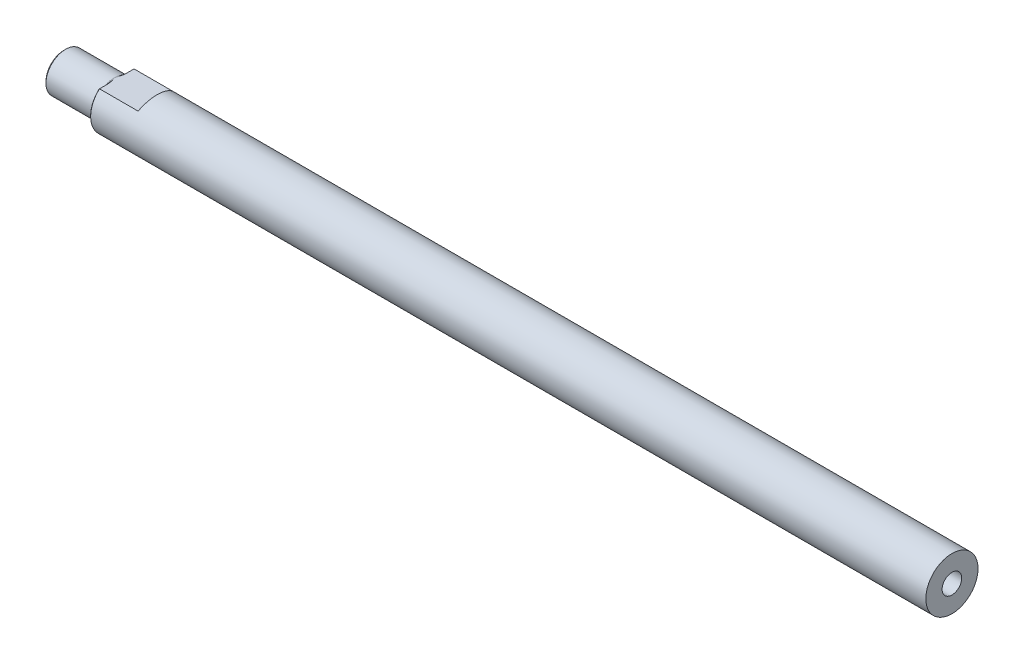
ISO-10303-21;
HEADER;
FILE_DESCRIPTION(('STEP AP214'),'2;1');
FILE_NAME('part.step','',(''),(''),'','','');
FILE_SCHEMA(('AUTOMOTIVE_DESIGN { 1 0 10303 214 1 1 1 1 }'));
ENDSEC;
DATA;
#1=APPLICATION_CONTEXT('core data for automotive mechanical design processes');
#2=APPLICATION_PROTOCOL_DEFINITION('international standard','automotive_design',2000,#1);
#3=PRODUCT_CONTEXT('',#1,'mechanical');
#4=PRODUCT('Part','Part','',(#3));
#5=PRODUCT_RELATED_PRODUCT_CATEGORY('part','',(#4));
#6=PRODUCT_DEFINITION_FORMATION('','',#4);
#7=PRODUCT_DEFINITION_CONTEXT('part definition',#1,'design');
#8=PRODUCT_DEFINITION('design','',#6,#7);
#9=PRODUCT_DEFINITION_SHAPE('','',#8);
#10=(LENGTH_UNIT() NAMED_UNIT(*) SI_UNIT(.MILLI.,.METRE.));
#11=(NAMED_UNIT(*) PLANE_ANGLE_UNIT() SI_UNIT($,.RADIAN.));
#12=(NAMED_UNIT(*) SI_UNIT($,.STERADIAN.) SOLID_ANGLE_UNIT());
#13=UNCERTAINTY_MEASURE_WITH_UNIT(LENGTH_MEASURE(1.E-05),#10,'distance_accuracy_value','');
#14=(GEOMETRIC_REPRESENTATION_CONTEXT(3) GLOBAL_UNCERTAINTY_ASSIGNED_CONTEXT((#13)) GLOBAL_UNIT_ASSIGNED_CONTEXT((#10,
#11,#12)) REPRESENTATION_CONTEXT('',''));
#15=CARTESIAN_POINT('',(0.,0.,0.));
#16=DIRECTION('',(0.,0.,1.));
#17=DIRECTION('',(1.,0.,0.));
#18=AXIS2_PLACEMENT_3D('',#15,#16,#17);
#19=CARTESIAN_POINT('',(-25.4,0.,0.));
#20=DIRECTION('',(1.,0.,0.));
#21=DIRECTION('',(0.,0.,-1.));
#22=AXIS2_PLACEMENT_3D('',#19,#20,#21);
#23=PLANE('',#22);
#24=CARTESIAN_POINT('',(-25.4,0.,0.));
#25=DIRECTION('',(1.,0.,0.));
#26=DIRECTION('',(0.,0.,-1.));
#27=AXIS2_PLACEMENT_3D('',#24,#25,#26);
#28=CIRCLE('',#27,8.76300000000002);
#29=CARTESIAN_POINT('',(-25.4,0.,-8.76300000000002));
#30=VERTEX_POINT('',#29);
#31=EDGE_CURVE('E107',#30,#30,#28,.F.);
#32=ORIENTED_EDGE('',*,*,#31,.T.);
#33=EDGE_LOOP('',(#32));
#34=FACE_BOUND('',#33,.T.);
#35=CARTESIAN_POINT('',(-25.4,0.,0.));
#36=DIRECTION('',(-1.,0.,0.));
#37=DIRECTION('',(0.,0.,1.));
#38=AXIS2_PLACEMENT_3D('',#35,#36,#37);
#39=CIRCLE('',#38,5.75437);
#40=CARTESIAN_POINT('',(-25.4,0.,5.75437));
#41=VERTEX_POINT('',#40);
#42=EDGE_CURVE('E120',#41,#41,#39,.T.);
#43=ORIENTED_EDGE('',*,*,#42,.F.);
#44=EDGE_LOOP('',(#43));
#45=FACE_BOUND('',#44,.T.);
#46=ADVANCED_FACE('F36',(#34,#45),#23,.F.);
#47=CARTESIAN_POINT('',(-34.7533783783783,0.,0.));
#48=DIRECTION('',(-1.,0.,0.));
#49=DIRECTION('',(0.,0.,1.));
#50=AXIS2_PLACEMENT_3D('',#47,#48,#49);
#51=CYLINDRICAL_SURFACE('',#50,9.525);
#52=CARTESIAN_POINT('',(-24.638,0.,0.));
#53=DIRECTION('',(1.,0.,0.));
#54=DIRECTION('',(0.,0.,-1.));
#55=AXIS2_PLACEMENT_3D('',#52,#53,#54);
#56=CIRCLE('',#55,9.525);
#57=CARTESIAN_POINT('',(-24.638,0.,-9.525));
#58=VERTEX_POINT('',#57);
#59=EDGE_CURVE('E328',#58,#58,#56,.T.);
#60=ORIENTED_EDGE('',*,*,#59,.T.);
#61=EDGE_LOOP('',(#60));
#62=FACE_BOUND('',#61,.T.);
#63=CARTESIAN_POINT('',(-0.761999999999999,0.,0.));
#64=DIRECTION('',(1.,0.,0.));
#65=DIRECTION('',(0.,0.,-1.));
#66=AXIS2_PLACEMENT_3D('',#63,#64,#65);
#67=CIRCLE('',#66,9.525);
#68=CARTESIAN_POINT('',(-0.761999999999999,9.525,0.));
#69=VERTEX_POINT('',#68);
#70=EDGE_CURVE('E129',#69,#69,#67,.F.);
#71=ORIENTED_EDGE('',*,*,#70,.T.);
#72=EDGE_LOOP('',(#71));
#73=FACE_BOUND('',#72,.T.);
#74=ADVANCED_FACE('F343',(#62,#73),#51,.T.);
#75=CARTESIAN_POINT('',(0.,9.525,0.));
#76=DIRECTION('',(1.,0.,0.));
#77=DIRECTION('',(0.,0.,-1.));
#78=AXIS2_PLACEMENT_3D('',#75,#76,#77);
#79=PLANE('',#78);
#80=CARTESIAN_POINT('',(0.,0.,0.));
#81=DIRECTION('',(1.,0.,0.));
#82=DIRECTION('',(0.,0.,-1.));
#83=AXIS2_PLACEMENT_3D('',#80,#81,#82);
#84=CIRCLE('',#83,10.287);
#85=CARTESIAN_POINT('',(0.,9.27100000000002,4.45768190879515));
#86=VERTEX_POINT('',#85);
#87=CARTESIAN_POINT('',(0.,9.27100000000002,-4.45768190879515));
#88=VERTEX_POINT('',#87);
#89=EDGE_CURVE('E108',#86,#88,#84,.T.);
#90=ORIENTED_EDGE('',*,*,#89,.T.);
#91=DIRECTION('',(0.,0.,-1.));
#92=VECTOR('',#91,1.);
#93=CARTESIAN_POINT('',(0.,9.27100000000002,0.));
#94=LINE('',#93,#92);
#95=CARTESIAN_POINT('',(0.,9.27100000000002,-8.30370248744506));
#96=VERTEX_POINT('',#95);
#97=EDGE_CURVE('E61',#88,#96,#94,.T.);
#98=ORIENTED_EDGE('',*,*,#97,.T.);
#99=CARTESIAN_POINT('',(0.,0.,0.));
#100=DIRECTION('',(1.,0.,0.));
#101=DIRECTION('',(0.,0.,-1.));
#102=AXIS2_PLACEMENT_3D('',#99,#100,#101);
#103=CIRCLE('',#102,12.4460000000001);
#104=CARTESIAN_POINT('',(0.,9.27100000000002,8.30370248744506));
#105=VERTEX_POINT('',#104);
#106=EDGE_CURVE('E327',#96,#105,#103,.F.);
#107=ORIENTED_EDGE('',*,*,#106,.T.);
#108=DIRECTION('',(0.,0.,-1.));
#109=VECTOR('',#108,1.);
#110=CARTESIAN_POINT('',(0.,9.27100000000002,0.));
#111=LINE('',#110,#109);
#112=EDGE_CURVE('E209',#105,#86,#111,.T.);
#113=ORIENTED_EDGE('',*,*,#112,.T.);
#114=EDGE_LOOP('',(#90,#98,#107,#113));
#115=FACE_BOUND('',#114,.T.);
#116=ADVANCED_FACE('F347',(#115),#79,.F.);
#117=CARTESIAN_POINT('',(-34.7533783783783,0.,0.));
#118=DIRECTION('',(-1.,0.,0.));
#119=DIRECTION('',(0.,0.,1.));
#120=AXIS2_PLACEMENT_3D('',#117,#118,#119);
#121=CYLINDRICAL_SURFACE('',#120,12.7);
#122=DIRECTION('',(-1.,0.,0.));
#123=VECTOR('',#122,1.);
#124=CARTESIAN_POINT('',(-34.7533783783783,9.525,8.40026041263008));
#125=LINE('',#124,#123);
#126=CARTESIAN_POINT('',(19.05,9.525,8.40026041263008));
#127=VERTEX_POINT('',#126);
#128=CARTESIAN_POINT('',(0.253999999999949,9.525,8.40026041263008));
#129=VERTEX_POINT('',#128);
#130=EDGE_CURVE('E101',#127,#129,#125,.T.);
#131=ORIENTED_EDGE('',*,*,#130,.T.);
#132=CARTESIAN_POINT('',(0.253999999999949,0.,0.));
#133=DIRECTION('',(1.,0.,0.));
#134=DIRECTION('',(0.,0.,-1.));
#135=AXIS2_PLACEMENT_3D('',#132,#133,#134);
#136=CIRCLE('',#135,12.7);
#137=CARTESIAN_POINT('',(0.253999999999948,9.525,-8.40026041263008));
#138=VERTEX_POINT('',#137);
#139=EDGE_CURVE('E97',#129,#138,#136,.T.);
#140=ORIENTED_EDGE('',*,*,#139,.T.);
#141=DIRECTION('',(-1.,0.,0.));
#142=VECTOR('',#141,1.);
#143=CARTESIAN_POINT('',(-34.7533783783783,9.525,-8.40026041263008));
#144=LINE('',#143,#142);
#145=CARTESIAN_POINT('',(19.05,9.525,-8.40026041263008));
#146=VERTEX_POINT('',#145);
#147=EDGE_CURVE('E90',#138,#146,#144,.F.);
#148=ORIENTED_EDGE('',*,*,#147,.T.);
#149=CARTESIAN_POINT('',(16.4977839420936,0.,0.));
#150=DIRECTION('',(0.965925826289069,-0.258819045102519,0.));
#151=DIRECTION('',(-0.258819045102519,-0.965925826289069,0.));
#152=AXIS2_PLACEMENT_3D('',#149,#150,#151);
#153=ELLIPSE('',#152,13.1480074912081,12.7);
#154=EDGE_CURVE('E95',#146,#127,#153,.T.);
#155=ORIENTED_EDGE('',*,*,#154,.T.);
#156=EDGE_LOOP('',(#131,#140,#148,#155));
#157=FACE_BOUND('',#156,.T.);
#158=CARTESIAN_POINT('',(406.4,0.,0.));
#159=DIRECTION('',(-1.,0.,0.));
#160=DIRECTION('',(0.,0.,1.));
#161=AXIS2_PLACEMENT_3D('',#158,#159,#160);
#162=CIRCLE('',#161,12.7);
#163=CARTESIAN_POINT('',(406.4,0.,12.7));
#164=VERTEX_POINT('',#163);
#165=EDGE_CURVE('E126',#164,#164,#162,.T.);
#166=ORIENTED_EDGE('',*,*,#165,.T.);
#167=EDGE_LOOP('',(#166));
#168=FACE_BOUND('',#167,.T.);
#169=ADVANCED_FACE('F93',(#157,#168),#121,.T.);
#170=CARTESIAN_POINT('',(406.4,12.7,0.));
#171=DIRECTION('',(-1.,0.,0.));
#172=DIRECTION('',(0.,0.,1.));
#173=AXIS2_PLACEMENT_3D('',#170,#171,#172);
#174=PLANE('',#173);
#175=CARTESIAN_POINT('',(406.4,0.,0.));
#176=DIRECTION('',(1.,0.,0.));
#177=DIRECTION('',(0.,0.,-1.));
#178=AXIS2_PLACEMENT_3D('',#175,#176,#177);
#179=CIRCLE('',#178,4.7625);
#180=CARTESIAN_POINT('',(406.4,0.,-4.7625));
#181=VERTEX_POINT('',#180);
#182=EDGE_CURVE('E116',#181,#181,#179,.T.);
#183=ORIENTED_EDGE('',*,*,#182,.F.);
#184=EDGE_LOOP('',(#183));
#185=FACE_BOUND('',#184,.T.);
#186=ORIENTED_EDGE('',*,*,#165,.F.);
#187=EDGE_LOOP('',(#186));
#188=FACE_BOUND('',#187,.T.);
#189=ADVANCED_FACE('F357',(#185,#188),#174,.F.);
#190=CARTESIAN_POINT('',(-5.715,0.,0.));
#191=DIRECTION('',(-1.,0.,0.));
#192=DIRECTION('',(0.,0.,1.));
#193=AXIS2_PLACEMENT_3D('',#190,#191,#192);
#194=CONICAL_SURFACE('',#193,5.75436999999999,1.02974425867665);
#195=CARTESIAN_POINT('',(-5.11902437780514,0.,0.));
#196=DIRECTION('',(-1.,0.,0.));
#197=DIRECTION('',(0.,0.,1.));
#198=AXIS2_PLACEMENT_3D('',#195,#196,#197);
#199=CIRCLE('',#198,4.7625);
#200=CARTESIAN_POINT('',(-5.11902437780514,0.,4.7625));
#201=VERTEX_POINT('',#200);
#202=EDGE_CURVE('E119',#201,#201,#199,.F.);
#203=ORIENTED_EDGE('',*,*,#202,.T.);
#204=EDGE_LOOP('',(#203));
#205=FACE_BOUND('',#204,.T.);
#206=CARTESIAN_POINT('',(-5.715,0.,0.));
#207=DIRECTION('',(-1.,0.,0.));
#208=DIRECTION('',(0.,0.,1.));
#209=AXIS2_PLACEMENT_3D('',#206,#207,#208);
#210=CIRCLE('',#209,5.75436999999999);
#211=CARTESIAN_POINT('',(-5.715,0.,5.75436999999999));
#212=VERTEX_POINT('',#211);
#213=EDGE_CURVE('E123',#212,#212,#210,.T.);
#214=ORIENTED_EDGE('',*,*,#213,.T.);
#215=EDGE_LOOP('',(#214));
#216=FACE_BOUND('',#215,.T.);
#217=ADVANCED_FACE('F360',(#205,#216),#194,.F.);
#218=CARTESIAN_POINT('',(-25.4,0.,0.));
#219=DIRECTION('',(-1.,0.,0.));
#220=DIRECTION('',(0.,0.,1.));
#221=AXIS2_PLACEMENT_3D('',#218,#219,#220);
#222=CYLINDRICAL_SURFACE('',#221,5.75437);
#223=ORIENTED_EDGE('',*,*,#213,.F.);
#224=EDGE_LOOP('',(#223));
#225=FACE_BOUND('',#224,.T.);
#226=ORIENTED_EDGE('',*,*,#42,.T.);
#227=EDGE_LOOP('',(#226));
#228=FACE_BOUND('',#227,.T.);
#229=ADVANCED_FACE('F160',(#225,#228),#222,.F.);
#230=CARTESIAN_POINT('',(-0.761999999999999,0.,0.));
#231=DIRECTION('',(1.,0.,0.));
#232=DIRECTION('',(0.,0.,-1.));
#233=AXIS2_PLACEMENT_3D('',#230,#231,#232);
#234=TOROIDAL_SURFACE('',#233,10.287,0.762);
#235=ORIENTED_EDGE('',*,*,#70,.F.);
#236=CARTESIAN_POINT('',(0.,9.27100000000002,-4.45768190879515));
#237=CARTESIAN_POINT('',(-2.16601705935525E-05,9.2897980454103,-4.27418202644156));
#238=CARTESIAN_POINT('',(-0.00760922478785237,9.30792786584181,-4.090594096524));
#239=CARTESIAN_POINT('',(-0.0338335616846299,9.34259620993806,-3.72268319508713));
#240=CARTESIAN_POINT('',(-0.0525102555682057,9.35913342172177,-3.53836583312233));
#241=CARTESIAN_POINT('',(-0.0868518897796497,9.38252798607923,-3.26114596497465));
#242=CARTESIAN_POINT('',(-0.0993642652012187,9.39009066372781,-3.16861761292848));
#243=CARTESIAN_POINT('',(-0.126256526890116,9.40470812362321,-2.9833028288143));
#244=CARTESIAN_POINT('',(-0.140637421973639,9.41176283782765,-2.89051654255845));
#245=CARTESIAN_POINT('',(-0.171039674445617,9.42532753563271,-2.70468156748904));
#246=CARTESIAN_POINT('',(-0.187059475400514,9.43183674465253,-2.61164381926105));
#247=CARTESIAN_POINT('',(-0.220541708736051,9.44427764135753,-2.42526623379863));
#248=CARTESIAN_POINT('',(-0.237987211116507,9.45020264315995,-2.33202377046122));
#249=CARTESIAN_POINT('',(-0.292092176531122,9.46702976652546,-2.05240928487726));
#250=CARTESIAN_POINT('',(-0.330542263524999,9.47699528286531,-1.86598436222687));
#251=CARTESIAN_POINT('',(-0.410832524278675,9.49422786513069,-1.49304662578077));
#252=CARTESIAN_POINT('',(-0.452678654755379,9.50149512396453,-1.30652607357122));
#253=CARTESIAN_POINT('',(-0.53856485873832,9.5131855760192,-0.933362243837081));
#254=CARTESIAN_POINT('',(-0.582611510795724,9.51760820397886,-0.746706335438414));
#255=CARTESIAN_POINT('',(-0.649479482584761,9.52203888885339,-0.466708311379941));
#256=CARTESIAN_POINT('',(-0.671911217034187,9.52314896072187,-0.373337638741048));
#257=CARTESIAN_POINT('',(-0.705646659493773,9.52425946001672,-0.233328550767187));
#258=CARTESIAN_POINT('',(-0.716915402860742,9.52453721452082,-0.186629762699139));
#259=CARTESIAN_POINT('',(-0.733818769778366,9.52481495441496,-0.11663183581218));
#260=CARTESIAN_POINT('',(-0.739460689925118,9.5248843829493,-0.0932768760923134));
#261=CARTESIAN_POINT('',(-0.750734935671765,9.52497693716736,-0.0466151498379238));
#262=CARTESIAN_POINT('',(-0.756389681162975,9.52500003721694,-0.0232157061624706));
#263=CARTESIAN_POINT('',(-0.761999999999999,9.52499999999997,0.));
#264=B_SPLINE_CURVE_WITH_KNOTS('',3,(#236,#237,#238,#239,#240,#241,#242,#243,#244,#245,#246,
#247,#248,#249,#250,#251,#252,#253,#254,#255,#256,#257,#258,#259,#260,#261,#262,#263),
.UNSPECIFIED.,.F.,.F.,(4,2,2,2,2,2,2,2,2,2,2,2,2,4),(0.,0.00057209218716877,0.00114418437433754,
0.00143023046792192,0.00171627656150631,0.00200232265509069,0.00228836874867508,
0.00286046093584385,0.00343255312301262,0.00400464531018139,0.00429069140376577,
0.00443371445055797,0.00450522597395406,0.00457673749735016),.UNSPECIFIED.);
#265=EDGE_CURVE('E326',#69,#88,#264,.F.);
#266=ORIENTED_EDGE('',*,*,#265,.T.);
#267=ORIENTED_EDGE('',*,*,#89,.F.);
#268=CARTESIAN_POINT('',(-0.761999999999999,9.52499999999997,0.));
#269=CARTESIAN_POINT('',(-0.7563896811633,9.52500003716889,0.0232157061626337));
#270=CARTESIAN_POINT('',(-0.750734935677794,9.52497693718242,0.0466151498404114));
#271=CARTESIAN_POINT('',(-0.739460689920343,9.52488438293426,0.0932768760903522));
#272=CARTESIAN_POINT('',(-0.73381876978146,9.52481495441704,0.116631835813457));
#273=CARTESIAN_POINT('',(-0.716915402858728,9.52453721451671,0.186629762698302));
#274=CARTESIAN_POINT('',(-0.705646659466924,9.52425946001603,0.233328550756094));
#275=CARTESIAN_POINT('',(-0.671911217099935,9.52314896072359,0.3733376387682));
#276=CARTESIAN_POINT('',(-0.649479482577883,9.52203888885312,0.466708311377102));
#277=CARTESIAN_POINT('',(-0.582611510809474,9.51760820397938,0.746706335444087));
#278=CARTESIAN_POINT('',(-0.538564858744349,9.51318557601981,0.933362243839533));
#279=CARTESIAN_POINT('',(-0.452678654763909,9.50149512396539,1.30652607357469));
#280=CARTESIAN_POINT('',(-0.41083252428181,9.49422786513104,1.49304662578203));
#281=CARTESIAN_POINT('',(-0.330542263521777,9.47699528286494,1.86598436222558));
#282=CARTESIAN_POINT('',(-0.292092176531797,9.46702976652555,2.05240928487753));
#283=CARTESIAN_POINT('',(-0.237987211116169,9.4502026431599,2.33202377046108));
#284=CARTESIAN_POINT('',(-0.220541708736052,9.44427764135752,2.42526623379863));
#285=CARTESIAN_POINT('',(-0.187059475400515,9.43183674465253,2.61164381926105));
#286=CARTESIAN_POINT('',(-0.171039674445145,9.42532753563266,2.70468156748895));
#287=CARTESIAN_POINT('',(-0.14063742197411,9.41176283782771,2.89051654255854));
#288=CARTESIAN_POINT('',(-0.126256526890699,9.40470812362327,2.98330282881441));
#289=CARTESIAN_POINT('',(-0.0993642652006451,9.39009066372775,3.16861761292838));
#290=CARTESIAN_POINT('',(-0.0868518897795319,9.38252798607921,3.26114596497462));
#291=CARTESIAN_POINT('',(-0.0525102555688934,9.35913342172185,3.53836583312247));
#292=CARTESIAN_POINT('',(-0.0338335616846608,9.34259620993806,3.72268319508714));
#293=CARTESIAN_POINT('',(-0.00760922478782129,9.30792786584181,4.09059409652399));
#294=CARTESIAN_POINT('',(-2.16601705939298E-05,9.2897980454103,4.27418202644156));
#295=CARTESIAN_POINT('',(0.,9.27100000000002,4.45768190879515));
#296=B_SPLINE_CURVE_WITH_KNOTS('',3,(#268,#269,#270,#271,#272,#273,#274,#275,#276,#277,#278,
#279,#280,#281,#282,#283,#284,#285,#286,#287,#288,#289,#290,#291,#292,#293,#294,#295),
.UNSPECIFIED.,.F.,.F.,(4,2,2,2,2,2,2,2,2,2,2,2,2,4),(0.,7.15115233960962E-05,
0.000143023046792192,0.000286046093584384,0.000572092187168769,0.00114418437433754,
0.00171627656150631,0.00228836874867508,0.00257441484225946,0.00286046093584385,
0.00314650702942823,0.00343255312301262,0.00400464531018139,0.00457673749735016),.UNSPECIFIED.);
#297=EDGE_CURVE('E142',#86,#69,#296,.F.);
#298=ORIENTED_EDGE('',*,*,#297,.T.);
#299=EDGE_LOOP('',(#235,#266,#267,#298));
#300=FACE_BOUND('',#299,.T.);
#301=ADVANCED_FACE('F149',(#300),#234,.F.);
#302=CARTESIAN_POINT('',(-25.4,0.,0.));
#303=DIRECTION('',(1.,0.,0.));
#304=DIRECTION('',(0.,0.,-1.));
#305=AXIS2_PLACEMENT_3D('',#302,#303,#304);
#306=CYLINDRICAL_SURFACE('',#305,4.7625);
#307=ORIENTED_EDGE('',*,*,#182,.T.);
#308=EDGE_LOOP('',(#307));
#309=FACE_BOUND('',#308,.T.);
#310=ORIENTED_EDGE('',*,*,#202,.F.);
#311=EDGE_LOOP('',(#310));
#312=FACE_BOUND('',#311,.T.);
#313=ADVANCED_FACE('F159',(#309,#312),#306,.F.);
#314=CARTESIAN_POINT('',(19.05,9.525,-12.7));
#315=DIRECTION('',(0.965925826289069,-0.258819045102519,0.));
#316=DIRECTION('',(0.258819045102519,0.965925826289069,0.));
#317=AXIS2_PLACEMENT_3D('',#314,#315,#316);
#318=PLANE('',#317);
#319=DIRECTION('',(0.,0.,1.));
#320=VECTOR('',#319,1.);
#321=CARTESIAN_POINT('',(19.05,9.525,-12.7));
#322=LINE('',#321,#320);
#323=EDGE_CURVE('E102',#146,#127,#322,.T.);
#324=ORIENTED_EDGE('',*,*,#323,.T.);
#325=ORIENTED_EDGE('',*,*,#154,.F.);
#326=EDGE_LOOP('',(#324,#325));
#327=FACE_BOUND('',#326,.T.);
#328=ADVANCED_FACE('F106',(#327),#318,.F.);
#329=CARTESIAN_POINT('',(-1.016,9.525,-12.7));
#330=DIRECTION('',(0.,-1.,0.));
#331=DIRECTION('',(0.,0.,-1.));
#332=AXIS2_PLACEMENT_3D('',#329,#330,#331);
#333=PLANE('',#332);
#334=ORIENTED_EDGE('',*,*,#147,.F.);
#335=DIRECTION('',(0.,0.,1.));
#336=VECTOR('',#335,1.);
#337=CARTESIAN_POINT('',(0.253999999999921,9.525,-12.7));
#338=LINE('',#337,#336);
#339=CARTESIAN_POINT('',(0.253999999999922,9.525,-4.45768190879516));
#340=VERTEX_POINT('',#339);
#341=EDGE_CURVE('E202',#138,#340,#338,.T.);
#342=ORIENTED_EDGE('',*,*,#341,.T.);
#343=CARTESIAN_POINT('',(-0.761999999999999,9.52500000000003,0.));
#344=CARTESIAN_POINT('',(-0.754519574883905,9.52499999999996,-0.0225966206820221));
#345=CARTESIAN_POINT('',(-0.746979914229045,9.52500000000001,-0.0453720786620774));
#346=CARTESIAN_POINT('',(-0.73194758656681,9.52499999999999,-0.0907904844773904));
#347=CARTESIAN_POINT('',(-0.724425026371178,9.525,-0.113523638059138));
#348=CARTESIAN_POINT('',(-0.701887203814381,9.525,-0.18166091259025));
#349=CARTESIAN_POINT('',(-0.686862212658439,9.525,-0.227122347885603));
#350=CARTESIAN_POINT('',(-0.64188162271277,9.525,-0.363445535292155));
#351=CARTESIAN_POINT('',(-0.611972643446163,9.525,-0.454389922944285));
#352=CARTESIAN_POINT('',(-0.522815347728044,9.525,-0.727302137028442));
#353=CARTESIAN_POINT('',(-0.46408647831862,9.525,-0.909488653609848));
#354=CARTESIAN_POINT('',(-0.34957153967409,9.525,-1.27471889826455));
#355=CARTESIAN_POINT('',(-0.293776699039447,9.525,-1.45777545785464));
#356=CARTESIAN_POINT('',(-0.186723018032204,9.525,-1.82525759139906));
#357=CARTESIAN_POINT('',(-0.135456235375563,9.525,-2.0096915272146));
#358=CARTESIAN_POINT('',(-0.0633162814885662,9.525,-2.28774684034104));
#359=CARTESIAN_POINT('',(-0.040055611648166,9.525,-2.3807076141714));
#360=CARTESIAN_POINT('',(0.00458736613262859,9.525,-2.5670472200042));
#361=CARTESIAN_POINT('',(0.0259471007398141,9.525,-2.66032866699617));
#362=CARTESIAN_POINT('',(0.0664834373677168,9.525,-2.84721848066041));
#363=CARTESIAN_POINT('',(0.0856579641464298,9.525,-2.94081589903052));
#364=CARTESIAN_POINT('',(0.121514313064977,9.525,-3.12835835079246));
#365=CARTESIAN_POINT('',(0.13819748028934,9.525,-3.22230319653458));
#366=CARTESIAN_POINT('',(0.183986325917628,9.525,-3.50473189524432));
#367=CARTESIAN_POINT('',(0.208888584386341,9.525,-3.6938019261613));
#368=CARTESIAN_POINT('',(0.243854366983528,9.525,-4.07401129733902));
#369=CARTESIAN_POINT('',(0.253971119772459,9.525,-4.26514321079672));
#370=CARTESIAN_POINT('',(0.253999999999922,9.525,-4.45768190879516));
#371=B_SPLINE_CURVE_WITH_KNOTS('',3,(#343,#344,#345,#346,#347,#348,#349,#350,#351,#352,#353,
#354,#355,#356,#357,#358,#359,#360,#361,#362,#363,#364,#365,#366,#367,#368,#369,#370),
.UNSPECIFIED.,.F.,.F.,(4,2,2,2,2,2,2,2,2,2,2,2,2,4),(0.,7.15115233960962E-05,
0.000143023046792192,0.000286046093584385,0.00057209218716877,0.00114418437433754,
0.00171627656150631,0.00228836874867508,0.00257441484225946,0.00286046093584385,
0.00314650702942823,0.00343255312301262,0.00400464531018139,0.00457673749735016),.UNSPECIFIED.);
#372=EDGE_CURVE('E210',#340,#69,#371,.F.);
#373=ORIENTED_EDGE('',*,*,#372,.T.);
#374=CARTESIAN_POINT('',(0.253999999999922,9.525,4.45768190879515));
#375=CARTESIAN_POINT('',(0.253971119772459,9.525,4.26514321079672));
#376=CARTESIAN_POINT('',(0.243854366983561,9.525,4.07401129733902));
#377=CARTESIAN_POINT('',(0.208888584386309,9.525,3.6938019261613));
#378=CARTESIAN_POINT('',(0.183986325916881,9.525,3.50473189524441));
#379=CARTESIAN_POINT('',(0.138197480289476,9.525,3.22230319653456));
#380=CARTESIAN_POINT('',(0.121514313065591,9.525,3.12835835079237));
#381=CARTESIAN_POINT('',(0.0856579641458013,9.525,2.94081589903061));
#382=CARTESIAN_POINT('',(0.0664834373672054,9.525,2.84721848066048));
#383=CARTESIAN_POINT('',(0.0259471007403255,9.525,2.66032866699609));
#384=CARTESIAN_POINT('',(0.00458736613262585,9.525,2.5670472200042));
#385=CARTESIAN_POINT('',(-0.0400556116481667,9.525,2.3807076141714));
#386=CARTESIAN_POINT('',(-0.0633162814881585,9.525,2.28774684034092));
#387=CARTESIAN_POINT('',(-0.135456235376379,9.525,2.00969152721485));
#388=CARTESIAN_POINT('',(-0.186723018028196,9.525,1.82525759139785));
#389=CARTESIAN_POINT('',(-0.29377669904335,9.525,1.45777545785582));
#390=CARTESIAN_POINT('',(-0.349571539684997,9.525,1.27471889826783));
#391=CARTESIAN_POINT('',(-0.464086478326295,9.525,0.909488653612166));
#392=CARTESIAN_POINT('',(-0.522815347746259,9.52499999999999,0.727302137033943));
#393=CARTESIAN_POINT('',(-0.611972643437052,9.525,0.454389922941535));
#394=CARTESIAN_POINT('',(-0.641881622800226,9.52499999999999,0.363445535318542));
#395=CARTESIAN_POINT('',(-0.686862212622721,9.525,0.227122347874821));
#396=CARTESIAN_POINT('',(-0.701887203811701,9.52499999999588,0.181660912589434));
#397=CARTESIAN_POINT('',(-0.724425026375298,9.52500000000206,0.113523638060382));
#398=CARTESIAN_POINT('',(-0.731947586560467,9.52499999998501,0.0907904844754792));
#399=CARTESIAN_POINT('',(-0.746979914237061,9.52500000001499,0.0453720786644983));
#400=CARTESIAN_POINT('',(-0.754519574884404,9.52499999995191,0.0225966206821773));
#401=CARTESIAN_POINT('',(-0.761999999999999,9.52500000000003,0.));
#402=B_SPLINE_CURVE_WITH_KNOTS('',3,(#374,#375,#376,#377,#378,#379,#380,#381,#382,#383,#384,
#385,#386,#387,#388,#389,#390,#391,#392,#393,#394,#395,#396,#397,#398,#399,#400,#401),
.UNSPECIFIED.,.F.,.F.,(4,2,2,2,2,2,2,2,2,2,2,2,2,4),(0.,0.000572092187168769,
0.00114418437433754,0.00143023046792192,0.00171627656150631,0.00200232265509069,
0.00228836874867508,0.00286046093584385,0.00343255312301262,0.00400464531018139,
0.00429069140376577,0.00443371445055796,0.00450522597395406,0.00457673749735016),.UNSPECIFIED.);
#403=CARTESIAN_POINT('',(0.253999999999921,9.525,4.45768190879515));
#404=VERTEX_POINT('',#403);
#405=EDGE_CURVE('E178',#69,#404,#402,.F.);
#406=ORIENTED_EDGE('',*,*,#405,.T.);
#407=DIRECTION('',(0.,0.,1.));
#408=VECTOR('',#407,1.);
#409=CARTESIAN_POINT('',(0.253999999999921,9.525,-12.7));
#410=LINE('',#409,#408);
#411=EDGE_CURVE('E184',#404,#129,#410,.T.);
#412=ORIENTED_EDGE('',*,*,#411,.T.);
#413=ORIENTED_EDGE('',*,*,#130,.F.);
#414=ORIENTED_EDGE('',*,*,#323,.F.);
#415=EDGE_LOOP('',(#334,#342,#373,#406,#412,#413,#414));
#416=FACE_BOUND('',#415,.T.);
#417=ADVANCED_FACE('F110',(#416),#333,.F.);
#418=CARTESIAN_POINT('',(-25.4,0.,0.));
#419=DIRECTION('',(1.,0.,0.));
#420=DIRECTION('',(0.,0.,-1.));
#421=AXIS2_PLACEMENT_3D('',#418,#419,#420);
#422=CONICAL_SURFACE('',#421,8.76300000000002,0.78539816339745);
#423=ORIENTED_EDGE('',*,*,#59,.F.);
#424=EDGE_LOOP('',(#423));
#425=FACE_BOUND('',#424,.T.);
#426=ORIENTED_EDGE('',*,*,#31,.F.);
#427=EDGE_LOOP('',(#426));
#428=FACE_BOUND('',#427,.T.);
#429=ADVANCED_FACE('F162',(#425,#428),#422,.T.);
#430=CARTESIAN_POINT('',(0.,0.,0.));
#431=DIRECTION('',(1.,0.,0.));
#432=DIRECTION('',(0.,0.,-1.));
#433=AXIS2_PLACEMENT_3D('',#430,#431,#432);
#434=CONICAL_SURFACE('',#433,12.4460000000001,0.785398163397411);
#435=ORIENTED_EDGE('',*,*,#106,.F.);
#436=CARTESIAN_POINT('',(0.,9.27100000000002,-8.30370248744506));
#437=CARTESIAN_POINT('',(0.0423168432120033,9.31331684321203,-8.31988223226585));
#438=CARTESIAN_POINT('',(0.0846419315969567,9.355641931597,-8.33601859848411));
#439=CARTESIAN_POINT('',(0.169308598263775,9.44030859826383,-8.36820457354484));
#440=CARTESIAN_POINT('',(0.211650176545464,9.48265017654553,-8.38425418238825));
#441=CARTESIAN_POINT('',(0.253999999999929,9.52500000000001,-8.40026041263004));
#442=B_SPLINE_CURVE_WITH_KNOTS('',3,(#436,#437,#438,#439,#440,#441),.UNSPECIFIED.,.F.,.F.,(4,2,
4),(0.,0.185980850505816,0.371961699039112),.UNSPECIFIED.);
#443=EDGE_CURVE('E11',#96,#138,#442,.T.);
#444=ORIENTED_EDGE('',*,*,#443,.T.);
#445=ORIENTED_EDGE('',*,*,#139,.F.);
#446=CARTESIAN_POINT('',(0.253999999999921,9.525,8.40026041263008));
#447=CARTESIAN_POINT('',(0.21165017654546,9.48265017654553,8.38425418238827));
#448=CARTESIAN_POINT('',(0.169308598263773,9.44030859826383,8.36820457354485));
#449=CARTESIAN_POINT('',(0.0846419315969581,9.355641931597,8.3360185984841));
#450=CARTESIAN_POINT('',(0.0423168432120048,9.31331684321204,8.31988223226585));
#451=CARTESIAN_POINT('',(0.,9.27100000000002,8.30370248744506));
#452=B_SPLINE_CURVE_WITH_KNOTS('',3,(#446,#447,#448,#449,#450,#451),.UNSPECIFIED.,.F.,.F.,(4,2,
4),(0.,0.185980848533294,0.37196169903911),.UNSPECIFIED.);
#453=EDGE_CURVE('E47',#129,#105,#452,.T.);
#454=ORIENTED_EDGE('',*,*,#453,.T.);
#455=EDGE_LOOP('',(#435,#444,#445,#454));
#456=FACE_BOUND('',#455,.T.);
#457=ADVANCED_FACE('F227',(#456),#434,.T.);
#458=CARTESIAN_POINT('',(0.,9.27100000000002,0.));
#459=DIRECTION('',(0.707106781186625,-0.70710678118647,0.));
#460=DIRECTION('',(0.,0.,-1.));
#461=AXIS2_PLACEMENT_3D('',#458,#459,#460);
#462=PLANE('',#461);
#463=ORIENTED_EDGE('',*,*,#443,.F.);
#464=ORIENTED_EDGE('',*,*,#97,.F.);
#465=CARTESIAN_POINT('',(0.253999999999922,9.525,-4.45768190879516));
#466=CARTESIAN_POINT('',(0.,9.27100000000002,-4.45768190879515));
#467=B_SPLINE_CURVE_WITH_KNOTS('',1,(#465,#466),.UNSPECIFIED.,.F.,.F.,(2,2),(0.,1.),.UNSPECIFIED.);
#468=EDGE_CURVE('E111',#340,#88,#467,.T.);
#469=ORIENTED_EDGE('',*,*,#468,.F.);
#470=ORIENTED_EDGE('',*,*,#341,.F.);
#471=EDGE_LOOP('',(#463,#464,#469,#470));
#472=FACE_BOUND('',#471,.T.);
#473=ADVANCED_FACE('F231',(#472),#462,.F.);
#474=CARTESIAN_POINT('',(-0.761999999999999,9.52499999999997,0.));
#475=CARTESIAN_POINT('',(-0.756389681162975,9.52500003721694,-0.0232157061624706));
#476=CARTESIAN_POINT('',(-0.750734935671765,9.52497693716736,-0.0466151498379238));
#477=CARTESIAN_POINT('',(-0.739460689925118,9.5248843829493,-0.0932768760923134));
#478=CARTESIAN_POINT('',(-0.733818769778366,9.52481495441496,-0.11663183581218));
#479=CARTESIAN_POINT('',(-0.716915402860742,9.52453721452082,-0.186629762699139));
#480=CARTESIAN_POINT('',(-0.705646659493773,9.52425946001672,-0.233328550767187));
#481=CARTESIAN_POINT('',(-0.671911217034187,9.52314896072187,-0.373337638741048));
#482=CARTESIAN_POINT('',(-0.649479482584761,9.52203888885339,-0.466708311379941));
#483=CARTESIAN_POINT('',(-0.582611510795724,9.51760820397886,-0.746706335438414));
#484=CARTESIAN_POINT('',(-0.53856485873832,9.5131855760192,-0.933362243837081));
#485=CARTESIAN_POINT('',(-0.452678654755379,9.50149512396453,-1.30652607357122));
#486=CARTESIAN_POINT('',(-0.410832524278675,9.49422786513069,-1.49304662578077));
#487=CARTESIAN_POINT('',(-0.330542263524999,9.47699528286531,-1.86598436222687));
#488=CARTESIAN_POINT('',(-0.292092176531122,9.46702976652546,-2.05240928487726));
#489=CARTESIAN_POINT('',(-0.237987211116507,9.45020264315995,-2.33202377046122));
#490=CARTESIAN_POINT('',(-0.220541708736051,9.44427764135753,-2.42526623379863));
#491=CARTESIAN_POINT('',(-0.187059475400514,9.43183674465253,-2.61164381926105));
#492=CARTESIAN_POINT('',(-0.171039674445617,9.42532753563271,-2.70468156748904));
#493=CARTESIAN_POINT('',(-0.140637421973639,9.41176283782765,-2.89051654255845));
#494=CARTESIAN_POINT('',(-0.126256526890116,9.40470812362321,-2.9833028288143));
#495=CARTESIAN_POINT('',(-0.0993642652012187,9.39009066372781,-3.16861761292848));
#496=CARTESIAN_POINT('',(-0.0868518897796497,9.38252798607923,-3.26114596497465));
#497=CARTESIAN_POINT('',(-0.0525102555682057,9.35913342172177,-3.53836583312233));
#498=CARTESIAN_POINT('',(-0.0338335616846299,9.34259620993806,-3.72268319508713));
#499=CARTESIAN_POINT('',(-0.00760922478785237,9.30792786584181,-4.090594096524));
#500=CARTESIAN_POINT('',(-2.16601705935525E-05,9.2897980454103,-4.27418202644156));
#501=CARTESIAN_POINT('',(0.,9.27100000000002,-4.45768190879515));
#502=CARTESIAN_POINT('',(-0.761999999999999,9.52500000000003,0.));
#503=CARTESIAN_POINT('',(-0.754519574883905,9.52499999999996,-0.0225966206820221));
#504=CARTESIAN_POINT('',(-0.746979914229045,9.52500000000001,-0.0453720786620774));
#505=CARTESIAN_POINT('',(-0.73194758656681,9.52499999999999,-0.0907904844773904));
#506=CARTESIAN_POINT('',(-0.724425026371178,9.525,-0.113523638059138));
#507=CARTESIAN_POINT('',(-0.701887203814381,9.525,-0.18166091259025));
#508=CARTESIAN_POINT('',(-0.686862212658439,9.525,-0.227122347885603));
#509=CARTESIAN_POINT('',(-0.64188162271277,9.525,-0.363445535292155));
#510=CARTESIAN_POINT('',(-0.611972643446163,9.525,-0.454389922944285));
#511=CARTESIAN_POINT('',(-0.522815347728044,9.525,-0.727302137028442));
#512=CARTESIAN_POINT('',(-0.46408647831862,9.525,-0.909488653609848));
#513=CARTESIAN_POINT('',(-0.34957153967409,9.525,-1.27471889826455));
#514=CARTESIAN_POINT('',(-0.293776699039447,9.525,-1.45777545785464));
#515=CARTESIAN_POINT('',(-0.186723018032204,9.525,-1.82525759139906));
#516=CARTESIAN_POINT('',(-0.135456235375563,9.525,-2.0096915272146));
#517=CARTESIAN_POINT('',(-0.0633162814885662,9.525,-2.28774684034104));
#518=CARTESIAN_POINT('',(-0.040055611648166,9.525,-2.3807076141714));
#519=CARTESIAN_POINT('',(0.00458736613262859,9.525,-2.5670472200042));
#520=CARTESIAN_POINT('',(0.0259471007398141,9.525,-2.66032866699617));
#521=CARTESIAN_POINT('',(0.0664834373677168,9.525,-2.84721848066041));
#522=CARTESIAN_POINT('',(0.0856579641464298,9.525,-2.94081589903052));
#523=CARTESIAN_POINT('',(0.121514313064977,9.525,-3.12835835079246));
#524=CARTESIAN_POINT('',(0.13819748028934,9.525,-3.22230319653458));
#525=CARTESIAN_POINT('',(0.183986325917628,9.525,-3.50473189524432));
#526=CARTESIAN_POINT('',(0.208888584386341,9.525,-3.6938019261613));
#527=CARTESIAN_POINT('',(0.243854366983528,9.525,-4.07401129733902));
#528=CARTESIAN_POINT('',(0.253971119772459,9.525,-4.26514321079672));
#529=CARTESIAN_POINT('',(0.253999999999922,9.525,-4.45768190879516));
#530=B_SPLINE_SURFACE_WITH_KNOTS('',1,3,((#474,#475,#476,#477,#478,#479,#480,#481,#482,#483,
#484,#485,#486,#487,#488,#489,#490,#491,#492,#493,#494,#495,#496,#497,#498,#499,#500,#501),
(#502,#503,#504,#505,#506,#507,#508,#509,#510,#511,#512,#513,#514,#515,#516,#517,#518,#519,#520,
#521,#522,#523,#524,#525,#526,#527,#528,#529)),.UNSPECIFIED.,.F.,.F.,.F.,(2,2),(4,2,2,2,2,2,2,2,
2,2,2,2,2,4),(0.,1.),(0.,7.15115233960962E-05,0.000143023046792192,0.000286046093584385,
0.00057209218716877,0.00114418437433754,0.00171627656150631,0.00228836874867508,
0.00257441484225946,0.00286046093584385,0.00314650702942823,0.00343255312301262,
0.00400464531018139,0.00457673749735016),.UNSPECIFIED.);
#531=ORIENTED_EDGE('',*,*,#265,.F.);
#532=ORIENTED_EDGE('',*,*,#372,.F.);
#533=ORIENTED_EDGE('',*,*,#468,.T.);
#534=EDGE_LOOP('',(#531,#532,#533));
#535=FACE_BOUND('',#534,.T.);
#536=ADVANCED_FACE('F232',(#535),#530,.T.);
#537=CARTESIAN_POINT('',(0.,9.27100000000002,0.));
#538=DIRECTION('',(0.707106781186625,-0.70710678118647,0.));
#539=DIRECTION('',(0.,0.,-1.));
#540=AXIS2_PLACEMENT_3D('',#537,#538,#539);
#541=PLANE('',#540);
#542=ORIENTED_EDGE('',*,*,#453,.F.);
#543=ORIENTED_EDGE('',*,*,#411,.F.);
#544=CARTESIAN_POINT('',(0.,9.27100000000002,4.45768190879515));
#545=CARTESIAN_POINT('',(0.253999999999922,9.525,4.45768190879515));
#546=B_SPLINE_CURVE_WITH_KNOTS('',1,(#544,#545),.UNSPECIFIED.,.F.,.F.,(2,2),(0.,1.),.UNSPECIFIED.);
#547=EDGE_CURVE('E113',#86,#404,#546,.T.);
#548=ORIENTED_EDGE('',*,*,#547,.F.);
#549=ORIENTED_EDGE('',*,*,#112,.F.);
#550=EDGE_LOOP('',(#542,#543,#548,#549));
#551=FACE_BOUND('',#550,.T.);
#552=ADVANCED_FACE('F38',(#551),#541,.F.);
#553=CARTESIAN_POINT('',(0.,9.27100000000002,4.45768190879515));
#554=CARTESIAN_POINT('',(-2.16601705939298E-05,9.2897980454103,4.27418202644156));
#555=CARTESIAN_POINT('',(-0.00760922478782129,9.30792786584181,4.09059409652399));
#556=CARTESIAN_POINT('',(-0.0338335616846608,9.34259620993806,3.72268319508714));
#557=CARTESIAN_POINT('',(-0.0525102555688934,9.35913342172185,3.53836583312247));
#558=CARTESIAN_POINT('',(-0.0868518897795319,9.38252798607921,3.26114596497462));
#559=CARTESIAN_POINT('',(-0.0993642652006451,9.39009066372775,3.16861761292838));
#560=CARTESIAN_POINT('',(-0.126256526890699,9.40470812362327,2.98330282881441));
#561=CARTESIAN_POINT('',(-0.14063742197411,9.41176283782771,2.89051654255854));
#562=CARTESIAN_POINT('',(-0.171039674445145,9.42532753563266,2.70468156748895));
#563=CARTESIAN_POINT('',(-0.187059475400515,9.43183674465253,2.61164381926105));
#564=CARTESIAN_POINT('',(-0.220541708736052,9.44427764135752,2.42526623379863));
#565=CARTESIAN_POINT('',(-0.237987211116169,9.4502026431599,2.33202377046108));
#566=CARTESIAN_POINT('',(-0.292092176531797,9.46702976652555,2.05240928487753));
#567=CARTESIAN_POINT('',(-0.330542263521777,9.47699528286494,1.86598436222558));
#568=CARTESIAN_POINT('',(-0.41083252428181,9.49422786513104,1.49304662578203));
#569=CARTESIAN_POINT('',(-0.452678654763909,9.50149512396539,1.30652607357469));
#570=CARTESIAN_POINT('',(-0.538564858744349,9.51318557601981,0.933362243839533));
#571=CARTESIAN_POINT('',(-0.582611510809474,9.51760820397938,0.746706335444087));
#572=CARTESIAN_POINT('',(-0.649479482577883,9.52203888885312,0.466708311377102));
#573=CARTESIAN_POINT('',(-0.671911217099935,9.52314896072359,0.3733376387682));
#574=CARTESIAN_POINT('',(-0.705646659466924,9.52425946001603,0.233328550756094));
#575=CARTESIAN_POINT('',(-0.716915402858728,9.52453721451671,0.186629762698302));
#576=CARTESIAN_POINT('',(-0.73381876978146,9.52481495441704,0.116631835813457));
#577=CARTESIAN_POINT('',(-0.739460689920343,9.52488438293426,0.0932768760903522));
#578=CARTESIAN_POINT('',(-0.750734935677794,9.52497693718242,0.0466151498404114));
#579=CARTESIAN_POINT('',(-0.7563896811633,9.52500003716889,0.0232157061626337));
#580=CARTESIAN_POINT('',(-0.761999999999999,9.52499999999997,0.));
#581=CARTESIAN_POINT('',(0.253999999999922,9.525,4.45768190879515));
#582=CARTESIAN_POINT('',(0.253971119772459,9.525,4.26514321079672));
#583=CARTESIAN_POINT('',(0.243854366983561,9.525,4.07401129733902));
#584=CARTESIAN_POINT('',(0.208888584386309,9.525,3.6938019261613));
#585=CARTESIAN_POINT('',(0.183986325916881,9.525,3.50473189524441));
#586=CARTESIAN_POINT('',(0.138197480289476,9.525,3.22230319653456));
#587=CARTESIAN_POINT('',(0.121514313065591,9.525,3.12835835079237));
#588=CARTESIAN_POINT('',(0.0856579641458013,9.525,2.94081589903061));
#589=CARTESIAN_POINT('',(0.0664834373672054,9.525,2.84721848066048));
#590=CARTESIAN_POINT('',(0.0259471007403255,9.525,2.66032866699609));
#591=CARTESIAN_POINT('',(0.00458736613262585,9.525,2.5670472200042));
#592=CARTESIAN_POINT('',(-0.0400556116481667,9.525,2.3807076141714));
#593=CARTESIAN_POINT('',(-0.0633162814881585,9.525,2.28774684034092));
#594=CARTESIAN_POINT('',(-0.135456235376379,9.525,2.00969152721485));
#595=CARTESIAN_POINT('',(-0.186723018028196,9.525,1.82525759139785));
#596=CARTESIAN_POINT('',(-0.29377669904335,9.525,1.45777545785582));
#597=CARTESIAN_POINT('',(-0.349571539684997,9.525,1.27471889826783));
#598=CARTESIAN_POINT('',(-0.464086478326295,9.525,0.909488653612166));
#599=CARTESIAN_POINT('',(-0.522815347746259,9.52499999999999,0.727302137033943));
#600=CARTESIAN_POINT('',(-0.611972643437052,9.525,0.454389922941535));
#601=CARTESIAN_POINT('',(-0.641881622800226,9.52499999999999,0.363445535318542));
#602=CARTESIAN_POINT('',(-0.686862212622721,9.525,0.227122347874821));
#603=CARTESIAN_POINT('',(-0.701887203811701,9.52499999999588,0.181660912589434));
#604=CARTESIAN_POINT('',(-0.724425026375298,9.52500000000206,0.113523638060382));
#605=CARTESIAN_POINT('',(-0.731947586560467,9.52499999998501,0.0907904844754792));
#606=CARTESIAN_POINT('',(-0.746979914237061,9.52500000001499,0.0453720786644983));
#607=CARTESIAN_POINT('',(-0.754519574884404,9.52499999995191,0.0225966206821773));
#608=CARTESIAN_POINT('',(-0.761999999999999,9.52500000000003,0.));
#609=B_SPLINE_SURFACE_WITH_KNOTS('',1,3,((#553,#554,#555,#556,#557,#558,#559,#560,#561,#562,
#563,#564,#565,#566,#567,#568,#569,#570,#571,#572,#573,#574,#575,#576,#577,#578,#579,#580),
(#581,#582,#583,#584,#585,#586,#587,#588,#589,#590,#591,#592,#593,#594,#595,#596,#597,#598,#599,
#600,#601,#602,#603,#604,#605,#606,#607,#608)),.UNSPECIFIED.,.F.,.F.,.F.,(2,2),(4,2,2,2,2,2,2,2,
2,2,2,2,2,4),(0.,1.),(0.,0.000572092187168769,0.00114418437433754,0.00143023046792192,
0.00171627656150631,0.00200232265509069,0.00228836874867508,0.00286046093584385,
0.00343255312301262,0.00400464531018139,0.00429069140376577,0.00443371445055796,
0.00450522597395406,0.00457673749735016),.UNSPECIFIED.);
#610=ORIENTED_EDGE('',*,*,#547,.T.);
#611=ORIENTED_EDGE('',*,*,#405,.F.);
#612=ORIENTED_EDGE('',*,*,#297,.F.);
#613=EDGE_LOOP('',(#610,#611,#612));
#614=FACE_BOUND('',#613,.T.);
#615=ADVANCED_FACE('F281',(#614),#609,.T.);
#616=CLOSED_SHELL('',(#46,#74,#116,#169,#189,#217,#229,#301,#313,#328,#417,#429,#457,#473,#536,
#552,#615));
#617=MANIFOLD_SOLID_BREP('B2',#616);
#618=ADVANCED_BREP_SHAPE_REPRESENTATION('',(#18,#617),#14);
#619=SHAPE_DEFINITION_REPRESENTATION(#9,#618);
ENDSEC;
END-ISO-10303-21;
